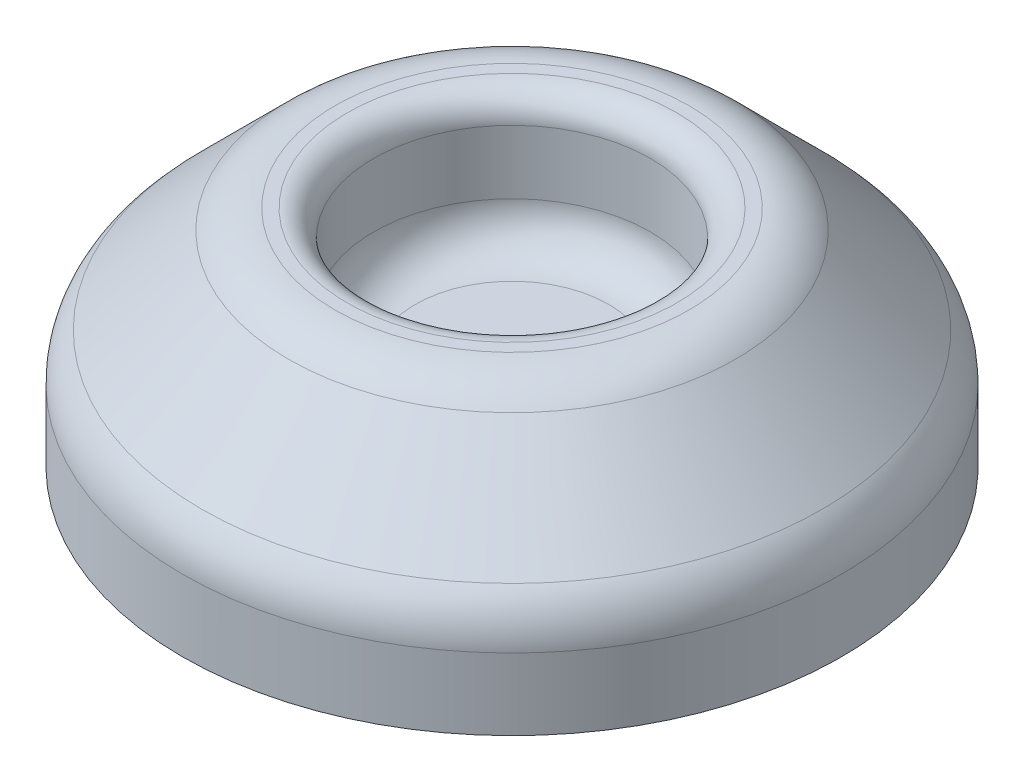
from build123d import *

# Parameters (mm, degrees)
FILLET1_R = 5
FILLET2_R = 2
FILLET3_R = 3.175
SHELL1_T  = -1


with BuildPart() as part:
    # Sketch2 → Revolve1 (revolve)
    with BuildSketch(Plane.XY, mode=Mode.PRIVATE) as revolve1_sk:
        Polygon((25, 0), (25, 7.5), (15.5, 17), (10.5, 17), (10.5, 7), (0, 7), (0, 0), align=None)
    revolve(revolve1_sk.sketch.rotate(Axis((0, 7, 0), (0, -1, 0)), 90), axis=Axis((0, 7, 0), (0, -1, 0)))

    # Fillet1
    fillet1_edges = [part.edges().sort_by_distance(p)[0] for p in [
        (0, 7.5, -25),
        (0, 17, -15.5),
    ]]
    fillet(fillet1_edges, radius=FILLET1_R)

    # Fillet2
    fillet2_edges = [part.edges().sort_by_distance(p)[0] for p in [
        (0, 17, -10.5),
    ]]
    fillet(fillet2_edges, radius=FILLET2_R)

    # Fillet3
    fillet3_edges = [part.edges().sort_by_distance(p)[0] for p in [
        (0, 7, -10.5),
    ]]
    fillet(fillet3_edges, radius=FILLET3_R)

    # Shell1
    shell1_openings = [part.faces().sort_by_distance(p)[0] for p in [
        (0, 0, 0),
    ]]
    offset(amount=SHELL1_T, openings=shell1_openings, kind=Kind.INTERSECTION)


solid = part.part
